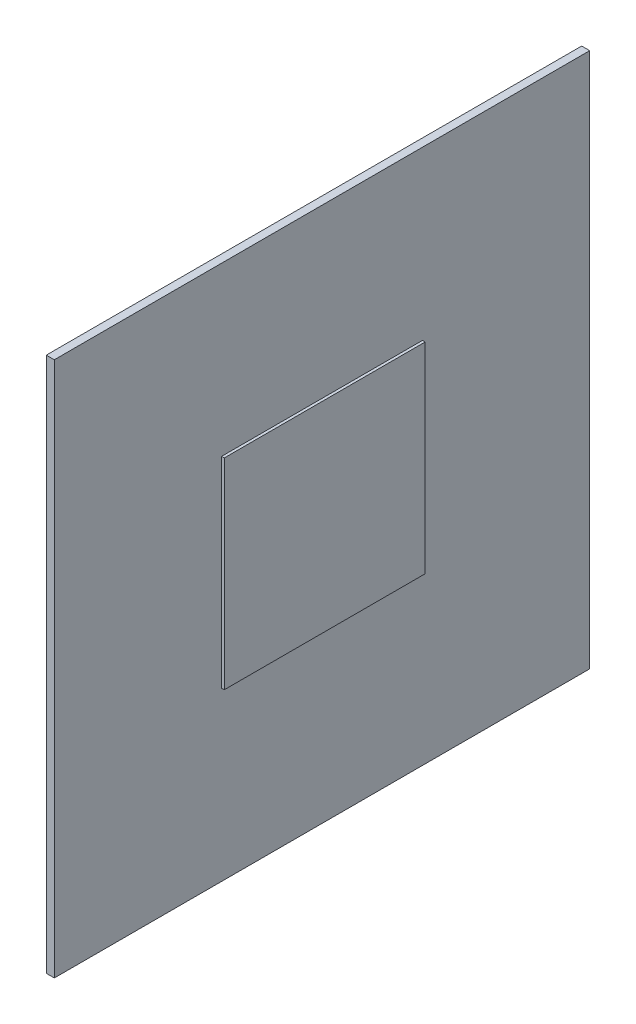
ISO-10303-21;
HEADER;
FILE_DESCRIPTION(('STEP AP214'),'2;1');
FILE_NAME('part.step','',(''),(''),'','','');
FILE_SCHEMA(('AUTOMOTIVE_DESIGN { 1 0 10303 214 1 1 1 1 }'));
ENDSEC;
DATA;
#1=APPLICATION_CONTEXT('core data for automotive mechanical design processes');
#2=APPLICATION_PROTOCOL_DEFINITION('international standard','automotive_design',2000,#1);
#3=PRODUCT_CONTEXT('',#1,'mechanical');
#4=PRODUCT('Part','Part','',(#3));
#5=PRODUCT_RELATED_PRODUCT_CATEGORY('part','',(#4));
#6=PRODUCT_DEFINITION_FORMATION('','',#4);
#7=PRODUCT_DEFINITION_CONTEXT('part definition',#1,'design');
#8=PRODUCT_DEFINITION('design','',#6,#7);
#9=PRODUCT_DEFINITION_SHAPE('','',#8);
#10=(LENGTH_UNIT() NAMED_UNIT(*) SI_UNIT(.MILLI.,.METRE.));
#11=(NAMED_UNIT(*) PLANE_ANGLE_UNIT() SI_UNIT($,.RADIAN.));
#12=(NAMED_UNIT(*) SI_UNIT($,.STERADIAN.) SOLID_ANGLE_UNIT());
#13=UNCERTAINTY_MEASURE_WITH_UNIT(LENGTH_MEASURE(1.E-05),#10,'distance_accuracy_value','');
#14=(GEOMETRIC_REPRESENTATION_CONTEXT(3) GLOBAL_UNCERTAINTY_ASSIGNED_CONTEXT((#13)) GLOBAL_UNIT_ASSIGNED_CONTEXT((#10,
#11,#12)) REPRESENTATION_CONTEXT('',''));
#15=CARTESIAN_POINT('',(0.,0.,0.));
#16=DIRECTION('',(0.,0.,1.));
#17=DIRECTION('',(1.,0.,0.));
#18=AXIS2_PLACEMENT_3D('',#15,#16,#17);
#19=CARTESIAN_POINT('',(0.762,0.,0.));
#20=DIRECTION('',(-1.,0.,0.));
#21=DIRECTION('',(0.,0.,1.));
#22=AXIS2_PLACEMENT_3D('',#19,#20,#21);
#23=PLANE('',#22);
#24=DIRECTION('',(0.,-1.,0.));
#25=VECTOR('',#24,1.);
#26=CARTESIAN_POINT('',(0.762,0.,0.));
#27=LINE('',#26,#25);
#28=CARTESIAN_POINT('',(0.762,50.8,0.));
#29=VERTEX_POINT('',#28);
#30=CARTESIAN_POINT('',(0.762,0.,0.));
#31=VERTEX_POINT('',#30);
#32=EDGE_CURVE('E130',#29,#31,#27,.T.);
#33=ORIENTED_EDGE('',*,*,#32,.T.);
#34=DIRECTION('',(0.,0.,-1.));
#35=VECTOR('',#34,1.);
#36=CARTESIAN_POINT('',(0.762,0.,0.));
#37=LINE('',#36,#35);
#38=CARTESIAN_POINT('',(0.762,0.,-50.8));
#39=VERTEX_POINT('',#38);
#40=EDGE_CURVE('E133',#31,#39,#37,.T.);
#41=ORIENTED_EDGE('',*,*,#40,.T.);
#42=DIRECTION('',(0.,1.,0.));
#43=VECTOR('',#42,1.);
#44=CARTESIAN_POINT('',(0.762,0.,-50.8));
#45=LINE('',#44,#43);
#46=CARTESIAN_POINT('',(0.762,50.8,-50.8));
#47=VERTEX_POINT('',#46);
#48=EDGE_CURVE('E136',#39,#47,#45,.T.);
#49=ORIENTED_EDGE('',*,*,#48,.T.);
#50=DIRECTION('',(0.,0.,1.));
#51=VECTOR('',#50,1.);
#52=CARTESIAN_POINT('',(0.762,50.8,0.));
#53=LINE('',#52,#51);
#54=EDGE_CURVE('E138',#47,#29,#53,.T.);
#55=ORIENTED_EDGE('',*,*,#54,.T.);
#56=EDGE_LOOP('',(#33,#41,#49,#55));
#57=FACE_BOUND('',#56,.T.);
#58=DIRECTION('',(0.,-1.,0.));
#59=VECTOR('',#58,1.);
#60=CARTESIAN_POINT('',(0.762,34.925,-15.875));
#61=LINE('',#60,#59);
#62=CARTESIAN_POINT('',(0.762,34.925,-15.875));
#63=VERTEX_POINT('',#62);
#64=CARTESIAN_POINT('',(0.762,15.875,-15.875));
#65=VERTEX_POINT('',#64);
#66=EDGE_CURVE('E120',#63,#65,#61,.T.);
#67=ORIENTED_EDGE('',*,*,#66,.F.);
#68=DIRECTION('',(0.,0.,1.));
#69=VECTOR('',#68,1.);
#70=CARTESIAN_POINT('',(0.762,34.925,-15.875));
#71=LINE('',#70,#69);
#72=CARTESIAN_POINT('',(0.762,34.925,-34.925));
#73=VERTEX_POINT('',#72);
#74=EDGE_CURVE('E117',#73,#63,#71,.T.);
#75=ORIENTED_EDGE('',*,*,#74,.F.);
#76=DIRECTION('',(0.,1.,0.));
#77=VECTOR('',#76,1.);
#78=CARTESIAN_POINT('',(0.762,34.925,-34.925));
#79=LINE('',#78,#77);
#80=CARTESIAN_POINT('',(0.762,15.875,-34.925));
#81=VERTEX_POINT('',#80);
#82=EDGE_CURVE('E55',#81,#73,#79,.T.);
#83=ORIENTED_EDGE('',*,*,#82,.F.);
#84=DIRECTION('',(0.,0.,-1.));
#85=VECTOR('',#84,1.);
#86=CARTESIAN_POINT('',(0.762,15.875,-15.875));
#87=LINE('',#86,#85);
#88=EDGE_CURVE('E50',#65,#81,#87,.T.);
#89=ORIENTED_EDGE('',*,*,#88,.F.);
#90=EDGE_LOOP('',(#67,#75,#83,#89));
#91=FACE_BOUND('',#90,.T.);
#92=ADVANCED_FACE('F35',(#57,#91),#23,.F.);
#93=CARTESIAN_POINT('',(0.762,0.,0.));
#94=DIRECTION('',(0.,0.,-1.));
#95=DIRECTION('',(-1.,0.,0.));
#96=AXIS2_PLACEMENT_3D('',#93,#94,#95);
#97=PLANE('',#96);
#98=DIRECTION('',(0.,-1.,0.));
#99=VECTOR('',#98,1.);
#100=CARTESIAN_POINT('',(0.,0.,0.));
#101=LINE('',#100,#99);
#102=CARTESIAN_POINT('',(0.,50.8,0.));
#103=VERTEX_POINT('',#102);
#104=CARTESIAN_POINT('',(0.,0.,0.));
#105=VERTEX_POINT('',#104);
#106=EDGE_CURVE('E121',#103,#105,#101,.T.);
#107=ORIENTED_EDGE('',*,*,#106,.T.);
#108=DIRECTION('',(-1.,0.,0.));
#109=VECTOR('',#108,1.);
#110=CARTESIAN_POINT('',(0.762,0.,0.));
#111=LINE('',#110,#109);
#112=EDGE_CURVE('E11',#31,#105,#111,.T.);
#113=ORIENTED_EDGE('',*,*,#112,.F.);
#114=ORIENTED_EDGE('',*,*,#32,.F.);
#115=DIRECTION('',(-1.,0.,0.));
#116=VECTOR('',#115,1.);
#117=CARTESIAN_POINT('',(0.762,50.8,0.));
#118=LINE('',#117,#116);
#119=EDGE_CURVE('E139',#29,#103,#118,.T.);
#120=ORIENTED_EDGE('',*,*,#119,.T.);
#121=EDGE_LOOP('',(#107,#113,#114,#120));
#122=FACE_BOUND('',#121,.T.);
#123=ADVANCED_FACE('F37',(#122),#97,.F.);
#124=CARTESIAN_POINT('',(0.762,0.,0.));
#125=DIRECTION('',(0.,1.,0.));
#126=DIRECTION('',(0.,0.,1.));
#127=AXIS2_PLACEMENT_3D('',#124,#125,#126);
#128=PLANE('',#127);
#129=DIRECTION('',(0.,0.,-1.));
#130=VECTOR('',#129,1.);
#131=CARTESIAN_POINT('',(0.,0.,0.));
#132=LINE('',#131,#130);
#133=CARTESIAN_POINT('',(0.,0.,-50.8));
#134=VERTEX_POINT('',#133);
#135=EDGE_CURVE('E124',#105,#134,#132,.T.);
#136=ORIENTED_EDGE('',*,*,#135,.T.);
#137=DIRECTION('',(-1.,0.,0.));
#138=VECTOR('',#137,1.);
#139=CARTESIAN_POINT('',(0.762,0.,-50.8));
#140=LINE('',#139,#138);
#141=EDGE_CURVE('E43',#39,#134,#140,.T.);
#142=ORIENTED_EDGE('',*,*,#141,.F.);
#143=ORIENTED_EDGE('',*,*,#40,.F.);
#144=ORIENTED_EDGE('',*,*,#112,.T.);
#145=EDGE_LOOP('',(#136,#142,#143,#144));
#146=FACE_BOUND('',#145,.T.);
#147=ADVANCED_FACE('F169',(#146),#128,.F.);
#148=CARTESIAN_POINT('',(0.762,0.,-50.8));
#149=DIRECTION('',(0.,0.,1.));
#150=DIRECTION('',(1.,0.,0.));
#151=AXIS2_PLACEMENT_3D('',#148,#149,#150);
#152=PLANE('',#151);
#153=DIRECTION('',(0.,1.,0.));
#154=VECTOR('',#153,1.);
#155=CARTESIAN_POINT('',(0.,0.,-50.8));
#156=LINE('',#155,#154);
#157=CARTESIAN_POINT('',(0.,50.8,-50.8));
#158=VERTEX_POINT('',#157);
#159=EDGE_CURVE('E142',#134,#158,#156,.T.);
#160=ORIENTED_EDGE('',*,*,#159,.T.);
#161=DIRECTION('',(-1.,0.,0.));
#162=VECTOR('',#161,1.);
#163=CARTESIAN_POINT('',(0.762,50.8,-50.8));
#164=LINE('',#163,#162);
#165=EDGE_CURVE('E147',#47,#158,#164,.T.);
#166=ORIENTED_EDGE('',*,*,#165,.F.);
#167=ORIENTED_EDGE('',*,*,#48,.F.);
#168=ORIENTED_EDGE('',*,*,#141,.T.);
#169=EDGE_LOOP('',(#160,#166,#167,#168));
#170=FACE_BOUND('',#169,.T.);
#171=ADVANCED_FACE('F154',(#170),#152,.F.);
#172=CARTESIAN_POINT('',(0.762,50.8,0.));
#173=DIRECTION('',(0.,-1.,0.));
#174=DIRECTION('',(0.,0.,-1.));
#175=AXIS2_PLACEMENT_3D('',#172,#173,#174);
#176=PLANE('',#175);
#177=DIRECTION('',(0.,0.,1.));
#178=VECTOR('',#177,1.);
#179=CARTESIAN_POINT('',(0.,50.8,0.));
#180=LINE('',#179,#178);
#181=EDGE_CURVE('E134',#158,#103,#180,.T.);
#182=ORIENTED_EDGE('',*,*,#181,.T.);
#183=ORIENTED_EDGE('',*,*,#119,.F.);
#184=ORIENTED_EDGE('',*,*,#54,.F.);
#185=ORIENTED_EDGE('',*,*,#165,.T.);
#186=EDGE_LOOP('',(#182,#183,#184,#185));
#187=FACE_BOUND('',#186,.T.);
#188=ADVANCED_FACE('F163',(#187),#176,.F.);
#189=CARTESIAN_POINT('',(0.,0.,0.));
#190=DIRECTION('',(-1.,0.,0.));
#191=DIRECTION('',(0.,0.,1.));
#192=AXIS2_PLACEMENT_3D('',#189,#190,#191);
#193=PLANE('',#192);
#194=ORIENTED_EDGE('',*,*,#106,.F.);
#195=ORIENTED_EDGE('',*,*,#181,.F.);
#196=ORIENTED_EDGE('',*,*,#159,.F.);
#197=ORIENTED_EDGE('',*,*,#135,.F.);
#198=EDGE_LOOP('',(#194,#195,#196,#197));
#199=FACE_BOUND('',#198,.T.);
#200=ADVANCED_FACE('F160',(#199),#193,.T.);
#201=CARTESIAN_POINT('',(1.016,34.925,-15.875));
#202=DIRECTION('',(0.,0.,-1.));
#203=DIRECTION('',(-1.,0.,0.));
#204=AXIS2_PLACEMENT_3D('',#201,#202,#203);
#205=PLANE('',#204);
#206=ORIENTED_EDGE('',*,*,#66,.T.);
#207=DIRECTION('',(-1.,0.,0.));
#208=VECTOR('',#207,1.);
#209=CARTESIAN_POINT('',(1.016,15.875,-15.875));
#210=LINE('',#209,#208);
#211=CARTESIAN_POINT('',(1.016,15.875,-15.875));
#212=VERTEX_POINT('',#211);
#213=EDGE_CURVE('E101',#212,#65,#210,.T.);
#214=ORIENTED_EDGE('',*,*,#213,.F.);
#215=DIRECTION('',(0.,-1.,0.));
#216=VECTOR('',#215,1.);
#217=CARTESIAN_POINT('',(1.016,34.925,-15.875));
#218=LINE('',#217,#216);
#219=CARTESIAN_POINT('',(1.016,34.925,-15.875));
#220=VERTEX_POINT('',#219);
#221=EDGE_CURVE('E108',#220,#212,#218,.T.);
#222=ORIENTED_EDGE('',*,*,#221,.F.);
#223=DIRECTION('',(-1.,0.,0.));
#224=VECTOR('',#223,1.);
#225=CARTESIAN_POINT('',(1.016,34.925,-15.875));
#226=LINE('',#225,#224);
#227=EDGE_CURVE('E246',#220,#63,#226,.T.);
#228=ORIENTED_EDGE('',*,*,#227,.T.);
#229=EDGE_LOOP('',(#206,#214,#222,#228));
#230=FACE_BOUND('',#229,.T.);
#231=ADVANCED_FACE('F119',(#230),#205,.F.);
#232=CARTESIAN_POINT('',(1.016,15.875,-15.875));
#233=DIRECTION('',(0.,1.,0.));
#234=DIRECTION('',(0.,0.,1.));
#235=AXIS2_PLACEMENT_3D('',#232,#233,#234);
#236=PLANE('',#235);
#237=ORIENTED_EDGE('',*,*,#88,.T.);
#238=DIRECTION('',(-1.,0.,0.));
#239=VECTOR('',#238,1.);
#240=CARTESIAN_POINT('',(1.016,15.875,-34.925));
#241=LINE('',#240,#239);
#242=CARTESIAN_POINT('',(1.016,15.875,-34.925));
#243=VERTEX_POINT('',#242);
#244=EDGE_CURVE('E104',#243,#81,#241,.T.);
#245=ORIENTED_EDGE('',*,*,#244,.F.);
#246=DIRECTION('',(0.,0.,-1.));
#247=VECTOR('',#246,1.);
#248=CARTESIAN_POINT('',(1.016,15.875,-15.875));
#249=LINE('',#248,#247);
#250=EDGE_CURVE('E97',#212,#243,#249,.T.);
#251=ORIENTED_EDGE('',*,*,#250,.F.);
#252=ORIENTED_EDGE('',*,*,#213,.T.);
#253=EDGE_LOOP('',(#237,#245,#251,#252));
#254=FACE_BOUND('',#253,.T.);
#255=ADVANCED_FACE('F99',(#254),#236,.F.);
#256=CARTESIAN_POINT('',(1.016,34.925,-34.925));
#257=DIRECTION('',(0.,0.,1.));
#258=DIRECTION('',(1.,0.,0.));
#259=AXIS2_PLACEMENT_3D('',#256,#257,#258);
#260=PLANE('',#259);
#261=ORIENTED_EDGE('',*,*,#82,.T.);
#262=DIRECTION('',(-1.,0.,0.));
#263=VECTOR('',#262,1.);
#264=CARTESIAN_POINT('',(1.016,34.925,-34.925));
#265=LINE('',#264,#263);
#266=CARTESIAN_POINT('',(1.016,34.925,-34.925));
#267=VERTEX_POINT('',#266);
#268=EDGE_CURVE('E126',#267,#73,#265,.T.);
#269=ORIENTED_EDGE('',*,*,#268,.F.);
#270=DIRECTION('',(0.,1.,0.));
#271=VECTOR('',#270,1.);
#272=CARTESIAN_POINT('',(1.016,34.925,-34.925));
#273=LINE('',#272,#271);
#274=EDGE_CURVE('E107',#243,#267,#273,.T.);
#275=ORIENTED_EDGE('',*,*,#274,.F.);
#276=ORIENTED_EDGE('',*,*,#244,.T.);
#277=EDGE_LOOP('',(#261,#269,#275,#276));
#278=FACE_BOUND('',#277,.T.);
#279=ADVANCED_FACE('F209',(#278),#260,.F.);
#280=CARTESIAN_POINT('',(1.016,34.925,-15.875));
#281=DIRECTION('',(0.,-1.,0.));
#282=DIRECTION('',(0.,0.,-1.));
#283=AXIS2_PLACEMENT_3D('',#280,#281,#282);
#284=PLANE('',#283);
#285=ORIENTED_EDGE('',*,*,#74,.T.);
#286=ORIENTED_EDGE('',*,*,#227,.F.);
#287=DIRECTION('',(0.,0.,1.));
#288=VECTOR('',#287,1.);
#289=CARTESIAN_POINT('',(1.016,34.925,-15.875));
#290=LINE('',#289,#288);
#291=EDGE_CURVE('E113',#267,#220,#290,.T.);
#292=ORIENTED_EDGE('',*,*,#291,.F.);
#293=ORIENTED_EDGE('',*,*,#268,.T.);
#294=EDGE_LOOP('',(#285,#286,#292,#293));
#295=FACE_BOUND('',#294,.T.);
#296=ADVANCED_FACE('F215',(#295),#284,.F.);
#297=CARTESIAN_POINT('',(1.016,0.,0.));
#298=DIRECTION('',(1.,0.,0.));
#299=DIRECTION('',(0.,0.,-1.));
#300=AXIS2_PLACEMENT_3D('',#297,#298,#299);
#301=PLANE('',#300);
#302=ORIENTED_EDGE('',*,*,#221,.T.);
#303=ORIENTED_EDGE('',*,*,#250,.T.);
#304=ORIENTED_EDGE('',*,*,#274,.T.);
#305=ORIENTED_EDGE('',*,*,#291,.T.);
#306=EDGE_LOOP('',(#302,#303,#304,#305));
#307=FACE_BOUND('',#306,.T.);
#308=ADVANCED_FACE('F111',(#307),#301,.T.);
#309=CLOSED_SHELL('',(#92,#123,#147,#171,#188,#200,#231,#255,#279,#296,#308));
#310=MANIFOLD_SOLID_BREP('B2',#309);
#311=ADVANCED_BREP_SHAPE_REPRESENTATION('',(#18,#310),#14);
#312=SHAPE_DEFINITION_REPRESENTATION(#9,#311);
ENDSEC;
END-ISO-10303-21;
